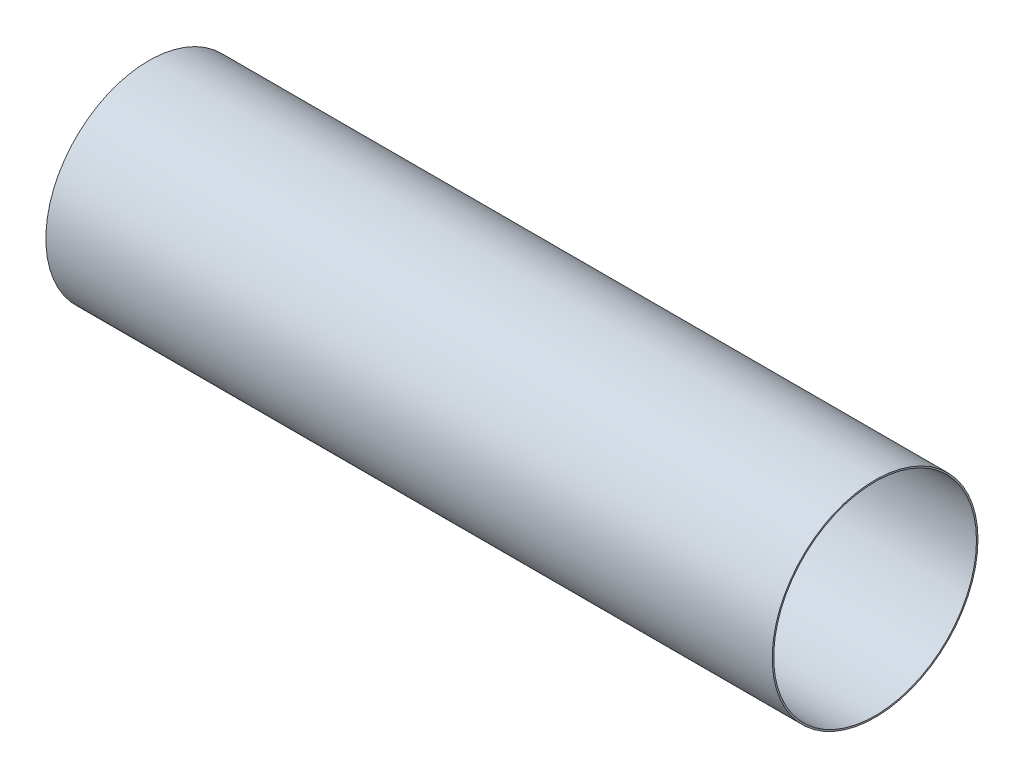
ISO-10303-21;
HEADER;
FILE_DESCRIPTION(('STEP AP214'),'2;1');
FILE_NAME('part.step','',(''),(''),'','','');
FILE_SCHEMA(('AUTOMOTIVE_DESIGN { 1 0 10303 214 1 1 1 1 }'));
ENDSEC;
DATA;
#1=APPLICATION_CONTEXT('core data for automotive mechanical design processes');
#2=APPLICATION_PROTOCOL_DEFINITION('international standard','automotive_design',2000,#1);
#3=PRODUCT_CONTEXT('',#1,'mechanical');
#4=PRODUCT('Part','Part','',(#3));
#5=PRODUCT_RELATED_PRODUCT_CATEGORY('part','',(#4));
#6=PRODUCT_DEFINITION_FORMATION('','',#4);
#7=PRODUCT_DEFINITION_CONTEXT('part definition',#1,'design');
#8=PRODUCT_DEFINITION('design','',#6,#7);
#9=PRODUCT_DEFINITION_SHAPE('','',#8);
#10=(LENGTH_UNIT() NAMED_UNIT(*) SI_UNIT(.MILLI.,.METRE.));
#11=(NAMED_UNIT(*) PLANE_ANGLE_UNIT() SI_UNIT($,.RADIAN.));
#12=(NAMED_UNIT(*) SI_UNIT($,.STERADIAN.) SOLID_ANGLE_UNIT());
#13=UNCERTAINTY_MEASURE_WITH_UNIT(LENGTH_MEASURE(1.E-05),#10,'distance_accuracy_value','');
#14=(GEOMETRIC_REPRESENTATION_CONTEXT(3) GLOBAL_UNCERTAINTY_ASSIGNED_CONTEXT((#13)) GLOBAL_UNIT_ASSIGNED_CONTEXT((#10,
#11,#12)) REPRESENTATION_CONTEXT('',''));
#15=CARTESIAN_POINT('',(0.,0.,0.));
#16=DIRECTION('',(0.,0.,1.));
#17=DIRECTION('',(1.,0.,0.));
#18=AXIS2_PLACEMENT_3D('',#15,#16,#17);
#19=CARTESIAN_POINT('',(120.,0.,0.));
#20=DIRECTION('',(1.,0.,0.));
#21=DIRECTION('',(0.,0.,-1.));
#22=AXIS2_PLACEMENT_3D('',#19,#20,#21);
#23=PLANE('',#22);
#24=CARTESIAN_POINT('',(120.,0.,0.));
#25=DIRECTION('',(1.,0.,0.));
#26=DIRECTION('',(0.,0.,-1.));
#27=AXIS2_PLACEMENT_3D('',#24,#25,#26);
#28=CIRCLE('',#27,17.);
#29=CARTESIAN_POINT('',(120.,0.,-17.));
#30=VERTEX_POINT('',#29);
#31=EDGE_CURVE('E10',#30,#30,#28,.T.);
#32=ORIENTED_EDGE('',*,*,#31,.T.);
#33=EDGE_LOOP('',(#32));
#34=FACE_BOUND('',#33,.T.);
#35=CARTESIAN_POINT('',(120.,0.,0.));
#36=DIRECTION('',(1.,0.,0.));
#37=DIRECTION('',(0.,0.,-1.));
#38=AXIS2_PLACEMENT_3D('',#35,#36,#37);
#39=CIRCLE('',#38,16.75);
#40=CARTESIAN_POINT('',(120.,0.,-16.75));
#41=VERTEX_POINT('',#40);
#42=EDGE_CURVE('E46',#41,#41,#39,.T.);
#43=ORIENTED_EDGE('',*,*,#42,.F.);
#44=EDGE_LOOP('',(#43));
#45=FACE_BOUND('',#44,.T.);
#46=ADVANCED_FACE('F35',(#34,#45),#23,.T.);
#47=CARTESIAN_POINT('',(0.,0.,0.));
#48=DIRECTION('',(1.,0.,0.));
#49=DIRECTION('',(0.,0.,-1.));
#50=AXIS2_PLACEMENT_3D('',#47,#48,#49);
#51=PLANE('',#50);
#52=CARTESIAN_POINT('',(0.,0.,0.));
#53=DIRECTION('',(1.,0.,0.));
#54=DIRECTION('',(0.,0.,-1.));
#55=AXIS2_PLACEMENT_3D('',#52,#53,#54);
#56=CIRCLE('',#55,17.);
#57=CARTESIAN_POINT('',(0.,0.,-17.));
#58=VERTEX_POINT('',#57);
#59=EDGE_CURVE('E39',#58,#58,#56,.T.);
#60=ORIENTED_EDGE('',*,*,#59,.F.);
#61=EDGE_LOOP('',(#60));
#62=FACE_BOUND('',#61,.T.);
#63=CARTESIAN_POINT('',(0.,0.,0.));
#64=DIRECTION('',(1.,0.,0.));
#65=DIRECTION('',(0.,0.,-1.));
#66=AXIS2_PLACEMENT_3D('',#63,#64,#65);
#67=CIRCLE('',#66,16.75);
#68=CARTESIAN_POINT('',(0.,0.,-16.75));
#69=VERTEX_POINT('',#68);
#70=EDGE_CURVE('E48',#69,#69,#67,.T.);
#71=ORIENTED_EDGE('',*,*,#70,.T.);
#72=EDGE_LOOP('',(#71));
#73=FACE_BOUND('',#72,.T.);
#74=ADVANCED_FACE('F58',(#62,#73),#51,.F.);
#75=CARTESIAN_POINT('',(120.,0.,0.));
#76=DIRECTION('',(-1.,0.,0.));
#77=DIRECTION('',(0.,0.,1.));
#78=AXIS2_PLACEMENT_3D('',#75,#76,#77);
#79=CYLINDRICAL_SURFACE('',#78,17.);
#80=ORIENTED_EDGE('',*,*,#31,.F.);
#81=EDGE_LOOP('',(#80));
#82=FACE_BOUND('',#81,.T.);
#83=ORIENTED_EDGE('',*,*,#59,.T.);
#84=EDGE_LOOP('',(#83));
#85=FACE_BOUND('',#84,.T.);
#86=ADVANCED_FACE('F37',(#82,#85),#79,.T.);
#87=CARTESIAN_POINT('',(120.,0.,0.));
#88=DIRECTION('',(-1.,0.,0.));
#89=DIRECTION('',(0.,0.,1.));
#90=AXIS2_PLACEMENT_3D('',#87,#88,#89);
#91=CYLINDRICAL_SURFACE('',#90,16.75);
#92=ORIENTED_EDGE('',*,*,#42,.T.);
#93=EDGE_LOOP('',(#92));
#94=FACE_BOUND('',#93,.T.);
#95=ORIENTED_EDGE('',*,*,#70,.F.);
#96=EDGE_LOOP('',(#95));
#97=FACE_BOUND('',#96,.T.);
#98=ADVANCED_FACE('F54',(#94,#97),#91,.F.);
#99=CLOSED_SHELL('',(#46,#74,#86,#98));
#100=MANIFOLD_SOLID_BREP('B2',#99);
#101=ADVANCED_BREP_SHAPE_REPRESENTATION('',(#18,#100),#14);
#102=SHAPE_DEFINITION_REPRESENTATION(#9,#101);
ENDSEC;
END-ISO-10303-21;
